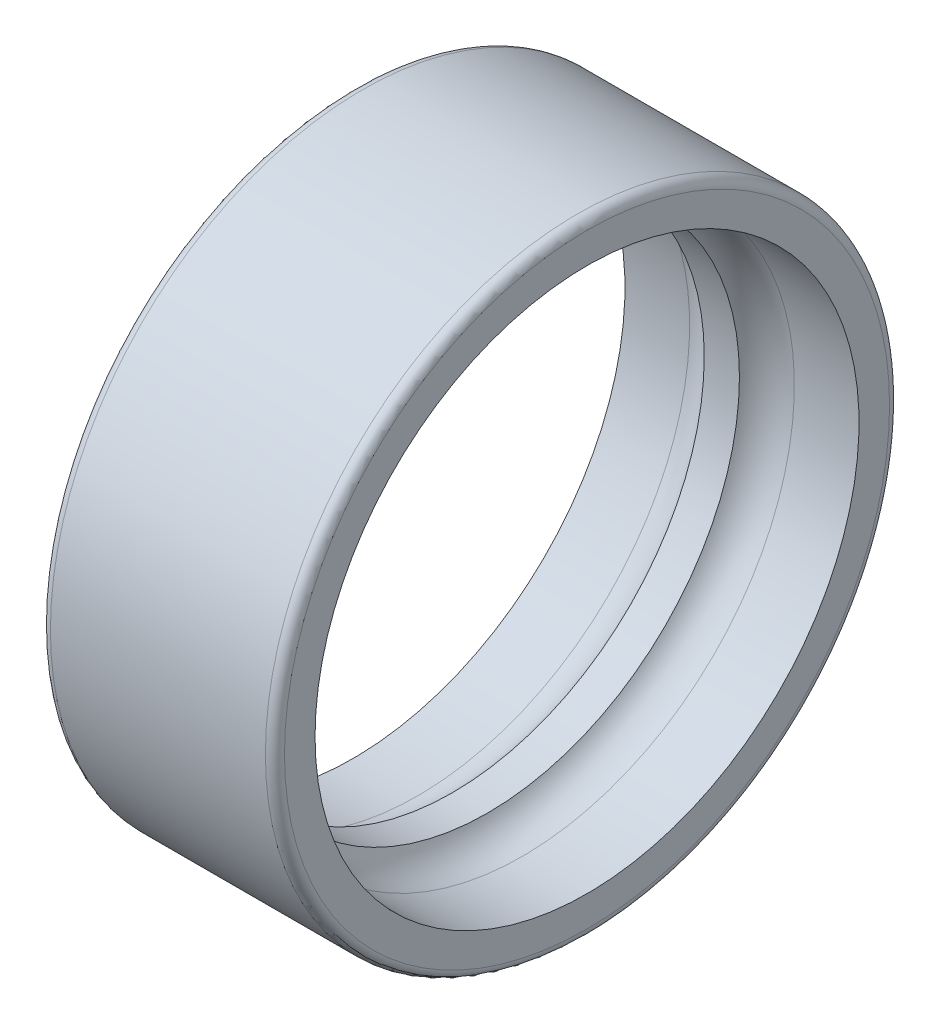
ISO-10303-21;
HEADER;
FILE_DESCRIPTION(('STEP AP214'),'2;1');
FILE_NAME('part.step','',(''),(''),'','','');
FILE_SCHEMA(('AUTOMOTIVE_DESIGN { 1 0 10303 214 1 1 1 1 }'));
ENDSEC;
DATA;
#1=APPLICATION_CONTEXT('core data for automotive mechanical design processes');
#2=APPLICATION_PROTOCOL_DEFINITION('international standard','automotive_design',2000,#1);
#3=PRODUCT_CONTEXT('',#1,'mechanical');
#4=PRODUCT('Part','Part','',(#3));
#5=PRODUCT_RELATED_PRODUCT_CATEGORY('part','',(#4));
#6=PRODUCT_DEFINITION_FORMATION('','',#4);
#7=PRODUCT_DEFINITION_CONTEXT('part definition',#1,'design');
#8=PRODUCT_DEFINITION('design','',#6,#7);
#9=PRODUCT_DEFINITION_SHAPE('','',#8);
#10=(LENGTH_UNIT() NAMED_UNIT(*) SI_UNIT(.MILLI.,.METRE.));
#11=(NAMED_UNIT(*) PLANE_ANGLE_UNIT() SI_UNIT($,.RADIAN.));
#12=(NAMED_UNIT(*) SI_UNIT($,.STERADIAN.) SOLID_ANGLE_UNIT());
#13=UNCERTAINTY_MEASURE_WITH_UNIT(LENGTH_MEASURE(1.E-05),#10,'distance_accuracy_value','');
#14=(GEOMETRIC_REPRESENTATION_CONTEXT(3) GLOBAL_UNCERTAINTY_ASSIGNED_CONTEXT((#13)) GLOBAL_UNIT_ASSIGNED_CONTEXT((#10,
#11,#12)) REPRESENTATION_CONTEXT('',''));
#15=CARTESIAN_POINT('',(0.,0.,0.));
#16=DIRECTION('',(0.,0.,1.));
#17=DIRECTION('',(1.,0.,0.));
#18=AXIS2_PLACEMENT_3D('',#15,#16,#17);
#19=CARTESIAN_POINT('',(-12.4,0.,0.));
#20=DIRECTION('',(-1.,0.,0.));
#21=DIRECTION('',(0.,0.,1.));
#22=AXIS2_PLACEMENT_3D('',#19,#20,#21);
#23=TOROIDAL_SURFACE('',#22,34.9,1.1);
#24=CARTESIAN_POINT('',(-13.5,0.,0.));
#25=DIRECTION('',(-1.,0.,0.));
#26=DIRECTION('',(0.,0.,1.));
#27=AXIS2_PLACEMENT_3D('',#24,#25,#26);
#28=CIRCLE('',#27,34.9);
#29=CARTESIAN_POINT('',(-13.5,0.,34.9));
#30=VERTEX_POINT('',#29);
#31=EDGE_CURVE('E10',#30,#30,#28,.T.);
#32=ORIENTED_EDGE('',*,*,#31,.F.);
#33=EDGE_LOOP('',(#32));
#34=FACE_BOUND('',#33,.T.);
#35=CARTESIAN_POINT('',(-12.4,0.,0.));
#36=DIRECTION('',(-1.,0.,0.));
#37=DIRECTION('',(0.,0.,1.));
#38=AXIS2_PLACEMENT_3D('',#35,#36,#37);
#39=CIRCLE('',#38,36.);
#40=CARTESIAN_POINT('',(-12.4,0.,36.));
#41=VERTEX_POINT('',#40);
#42=EDGE_CURVE('E64',#41,#41,#39,.T.);
#43=ORIENTED_EDGE('',*,*,#42,.T.);
#44=EDGE_LOOP('',(#43));
#45=FACE_BOUND('',#44,.T.);
#46=ADVANCED_FACE('F30',(#34,#45),#23,.T.);
#47=CARTESIAN_POINT('',(-13.5,34.9000000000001,0.));
#48=DIRECTION('',(1.,0.,0.));
#49=DIRECTION('',(0.,0.,-1.));
#50=AXIS2_PLACEMENT_3D('',#47,#48,#49);
#51=PLANE('',#50);
#52=CARTESIAN_POINT('',(-13.5,0.,0.));
#53=DIRECTION('',(-1.,0.,0.));
#54=DIRECTION('',(0.,0.,1.));
#55=AXIS2_PLACEMENT_3D('',#52,#53,#54);
#56=CIRCLE('',#55,31.375);
#57=CARTESIAN_POINT('',(-13.5,0.,31.375));
#58=VERTEX_POINT('',#57);
#59=EDGE_CURVE('E36',#58,#58,#56,.T.);
#60=ORIENTED_EDGE('',*,*,#59,.F.);
#61=EDGE_LOOP('',(#60));
#62=FACE_BOUND('',#61,.T.);
#63=ORIENTED_EDGE('',*,*,#31,.T.);
#64=EDGE_LOOP('',(#63));
#65=FACE_BOUND('',#64,.T.);
#66=ADVANCED_FACE('F113',(#62,#65),#51,.F.);
#67=CARTESIAN_POINT('',(0.,0.,0.));
#68=DIRECTION('',(-1.,0.,0.));
#69=DIRECTION('',(0.,0.,1.));
#70=AXIS2_PLACEMENT_3D('',#67,#68,#69);
#71=CYLINDRICAL_SURFACE('',#70,31.375);
#72=CARTESIAN_POINT('',(-6.04166666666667,0.,0.));
#73=DIRECTION('',(-1.,0.,0.));
#74=DIRECTION('',(0.,0.,1.));
#75=AXIS2_PLACEMENT_3D('',#72,#73,#74);
#76=CIRCLE('',#75,31.375);
#77=CARTESIAN_POINT('',(-6.04166666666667,0.,31.375));
#78=VERTEX_POINT('',#77);
#79=EDGE_CURVE('E40',#78,#78,#76,.T.);
#80=ORIENTED_EDGE('',*,*,#79,.F.);
#81=EDGE_LOOP('',(#80));
#82=FACE_BOUND('',#81,.T.);
#83=ORIENTED_EDGE('',*,*,#59,.T.);
#84=EDGE_LOOP('',(#83));
#85=FACE_BOUND('',#84,.T.);
#86=ADVANCED_FACE('F108',(#82,#85),#71,.F.);
#87=CARTESIAN_POINT('',(-6.04166666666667,0.,0.));
#88=DIRECTION('',(-1.,0.,0.));
#89=DIRECTION('',(0.,0.,1.));
#90=AXIS2_PLACEMENT_3D('',#87,#88,#89);
#91=TOROIDAL_SURFACE('',#90,26.75,4.625);
#92=CARTESIAN_POINT('',(-2.02910825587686,0.,0.));
#93=DIRECTION('',(-1.,0.,0.));
#94=DIRECTION('',(0.,0.,1.));
#95=AXIS2_PLACEMENT_3D('',#92,#93,#94);
#96=CIRCLE('',#95,29.05);
#97=CARTESIAN_POINT('',(-2.02910825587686,0.,29.05));
#98=VERTEX_POINT('',#97);
#99=EDGE_CURVE('E44',#98,#98,#96,.T.);
#100=ORIENTED_EDGE('',*,*,#99,.F.);
#101=EDGE_LOOP('',(#100));
#102=FACE_BOUND('',#101,.T.);
#103=ORIENTED_EDGE('',*,*,#79,.T.);
#104=EDGE_LOOP('',(#103));
#105=FACE_BOUND('',#104,.T.);
#106=ADVANCED_FACE('F102',(#102,#105),#91,.F.);
#107=CARTESIAN_POINT('',(0.,0.,0.));
#108=DIRECTION('',(-1.,0.,0.));
#109=DIRECTION('',(0.,0.,1.));
#110=AXIS2_PLACEMENT_3D('',#107,#108,#109);
#111=CYLINDRICAL_SURFACE('',#110,29.05);
#112=CARTESIAN_POINT('',(2.02910825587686,0.,0.));
#113=DIRECTION('',(-1.,0.,0.));
#114=DIRECTION('',(0.,0.,1.));
#115=AXIS2_PLACEMENT_3D('',#112,#113,#114);
#116=CIRCLE('',#115,29.05);
#117=CARTESIAN_POINT('',(2.02910825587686,0.,29.05));
#118=VERTEX_POINT('',#117);
#119=EDGE_CURVE('E49',#118,#118,#116,.T.);
#120=ORIENTED_EDGE('',*,*,#119,.F.);
#121=EDGE_LOOP('',(#120));
#122=FACE_BOUND('',#121,.T.);
#123=ORIENTED_EDGE('',*,*,#99,.T.);
#124=EDGE_LOOP('',(#123));
#125=FACE_BOUND('',#124,.T.);
#126=ADVANCED_FACE('F96',(#122,#125),#111,.F.);
#127=CARTESIAN_POINT('',(6.04166666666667,0.,0.));
#128=DIRECTION('',(-1.,0.,0.));
#129=DIRECTION('',(0.,0.,1.));
#130=AXIS2_PLACEMENT_3D('',#127,#128,#129);
#131=TOROIDAL_SURFACE('',#130,26.75,4.625);
#132=CARTESIAN_POINT('',(6.04166666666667,0.,0.));
#133=DIRECTION('',(-1.,0.,0.));
#134=DIRECTION('',(0.,0.,1.));
#135=AXIS2_PLACEMENT_3D('',#132,#133,#134);
#136=CIRCLE('',#135,31.375);
#137=CARTESIAN_POINT('',(6.04166666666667,0.,31.375));
#138=VERTEX_POINT('',#137);
#139=EDGE_CURVE('E52',#138,#138,#136,.T.);
#140=ORIENTED_EDGE('',*,*,#139,.F.);
#141=EDGE_LOOP('',(#140));
#142=FACE_BOUND('',#141,.T.);
#143=ORIENTED_EDGE('',*,*,#119,.T.);
#144=EDGE_LOOP('',(#143));
#145=FACE_BOUND('',#144,.T.);
#146=ADVANCED_FACE('F90',(#142,#145),#131,.F.);
#147=CARTESIAN_POINT('',(0.,0.,0.));
#148=DIRECTION('',(-1.,0.,0.));
#149=DIRECTION('',(0.,0.,1.));
#150=AXIS2_PLACEMENT_3D('',#147,#148,#149);
#151=CYLINDRICAL_SURFACE('',#150,31.375);
#152=CARTESIAN_POINT('',(13.5,0.,0.));
#153=DIRECTION('',(-1.,0.,0.));
#154=DIRECTION('',(0.,0.,1.));
#155=AXIS2_PLACEMENT_3D('',#152,#153,#154);
#156=CIRCLE('',#155,31.375);
#157=CARTESIAN_POINT('',(13.5,0.,31.375));
#158=VERTEX_POINT('',#157);
#159=EDGE_CURVE('E55',#158,#158,#156,.T.);
#160=ORIENTED_EDGE('',*,*,#159,.F.);
#161=EDGE_LOOP('',(#160));
#162=FACE_BOUND('',#161,.T.);
#163=ORIENTED_EDGE('',*,*,#139,.T.);
#164=EDGE_LOOP('',(#163));
#165=FACE_BOUND('',#164,.T.);
#166=ADVANCED_FACE('F84',(#162,#165),#151,.F.);
#167=CARTESIAN_POINT('',(13.5,34.9,0.));
#168=DIRECTION('',(-1.,0.,0.));
#169=DIRECTION('',(0.,0.,1.));
#170=AXIS2_PLACEMENT_3D('',#167,#168,#169);
#171=PLANE('',#170);
#172=CARTESIAN_POINT('',(13.5,0.,0.));
#173=DIRECTION('',(-1.,0.,0.));
#174=DIRECTION('',(0.,0.,1.));
#175=AXIS2_PLACEMENT_3D('',#172,#173,#174);
#176=CIRCLE('',#175,34.9);
#177=CARTESIAN_POINT('',(13.5,0.,34.9));
#178=VERTEX_POINT('',#177);
#179=EDGE_CURVE('E58',#178,#178,#176,.T.);
#180=ORIENTED_EDGE('',*,*,#179,.F.);
#181=EDGE_LOOP('',(#180));
#182=FACE_BOUND('',#181,.T.);
#183=ORIENTED_EDGE('',*,*,#159,.T.);
#184=EDGE_LOOP('',(#183));
#185=FACE_BOUND('',#184,.T.);
#186=ADVANCED_FACE('F78',(#182,#185),#171,.F.);
#187=CARTESIAN_POINT('',(12.4,0.,0.));
#188=DIRECTION('',(-1.,0.,0.));
#189=DIRECTION('',(0.,0.,1.));
#190=AXIS2_PLACEMENT_3D('',#187,#188,#189);
#191=TOROIDAL_SURFACE('',#190,34.9,1.1);
#192=CARTESIAN_POINT('',(12.4,0.,0.));
#193=DIRECTION('',(-1.,0.,0.));
#194=DIRECTION('',(0.,0.,1.));
#195=AXIS2_PLACEMENT_3D('',#192,#193,#194);
#196=CIRCLE('',#195,36.);
#197=CARTESIAN_POINT('',(12.4,0.,36.));
#198=VERTEX_POINT('',#197);
#199=EDGE_CURVE('E61',#198,#198,#196,.T.);
#200=ORIENTED_EDGE('',*,*,#199,.F.);
#201=EDGE_LOOP('',(#200));
#202=FACE_BOUND('',#201,.T.);
#203=ORIENTED_EDGE('',*,*,#179,.T.);
#204=EDGE_LOOP('',(#203));
#205=FACE_BOUND('',#204,.T.);
#206=ADVANCED_FACE('F72',(#202,#205),#191,.T.);
#207=CARTESIAN_POINT('',(0.,0.,0.));
#208=DIRECTION('',(-1.,0.,0.));
#209=DIRECTION('',(0.,0.,1.));
#210=AXIS2_PLACEMENT_3D('',#207,#208,#209);
#211=CYLINDRICAL_SURFACE('',#210,36.);
#212=ORIENTED_EDGE('',*,*,#42,.F.);
#213=EDGE_LOOP('',(#212));
#214=FACE_BOUND('',#213,.T.);
#215=ORIENTED_EDGE('',*,*,#199,.T.);
#216=EDGE_LOOP('',(#215));
#217=FACE_BOUND('',#216,.T.);
#218=ADVANCED_FACE('F69',(#214,#217),#211,.T.);
#219=CLOSED_SHELL('',(#46,#66,#86,#106,#126,#146,#166,#186,#206,#218));
#220=MANIFOLD_SOLID_BREP('B2',#219);
#221=ADVANCED_BREP_SHAPE_REPRESENTATION('',(#18,#220),#14);
#222=SHAPE_DEFINITION_REPRESENTATION(#9,#221);
ENDSEC;
END-ISO-10303-21;
